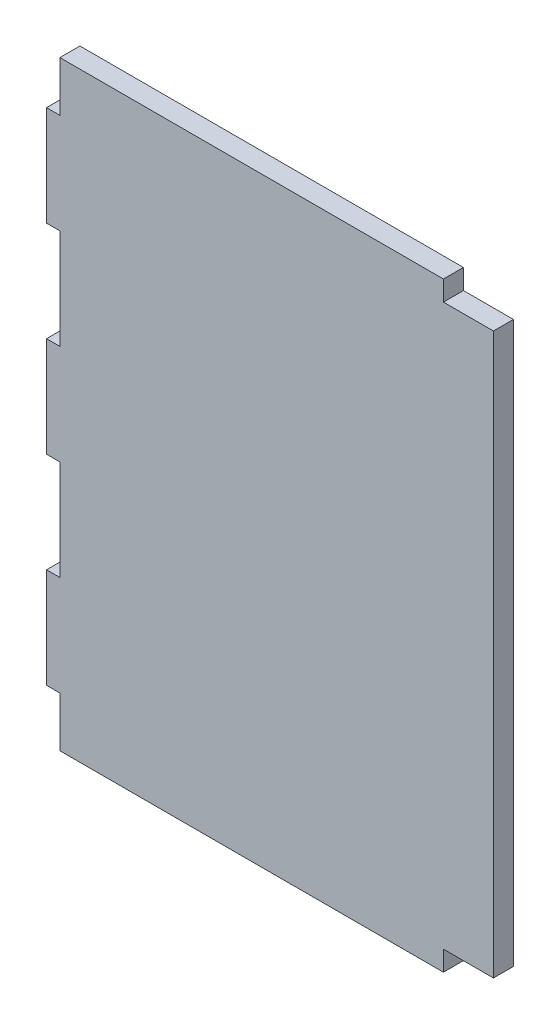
ISO-10303-21;
HEADER;
FILE_DESCRIPTION(('STEP AP214'),'2;1');
FILE_NAME('part.step','',(''),(''),'','','');
FILE_SCHEMA(('AUTOMOTIVE_DESIGN { 1 0 10303 214 1 1 1 1 }'));
ENDSEC;
DATA;
#1=APPLICATION_CONTEXT('core data for automotive mechanical design processes');
#2=APPLICATION_PROTOCOL_DEFINITION('international standard','automotive_design',2000,#1);
#3=PRODUCT_CONTEXT('',#1,'mechanical');
#4=PRODUCT('Part','Part','',(#3));
#5=PRODUCT_RELATED_PRODUCT_CATEGORY('part','',(#4));
#6=PRODUCT_DEFINITION_FORMATION('','',#4);
#7=PRODUCT_DEFINITION_CONTEXT('part definition',#1,'design');
#8=PRODUCT_DEFINITION('design','',#6,#7);
#9=PRODUCT_DEFINITION_SHAPE('','',#8);
#10=(LENGTH_UNIT() NAMED_UNIT(*) SI_UNIT(.MILLI.,.METRE.));
#11=(NAMED_UNIT(*) PLANE_ANGLE_UNIT() SI_UNIT($,.RADIAN.));
#12=(NAMED_UNIT(*) SI_UNIT($,.STERADIAN.) SOLID_ANGLE_UNIT());
#13=UNCERTAINTY_MEASURE_WITH_UNIT(LENGTH_MEASURE(1.E-05),#10,'distance_accuracy_value','');
#14=(GEOMETRIC_REPRESENTATION_CONTEXT(3) GLOBAL_UNCERTAINTY_ASSIGNED_CONTEXT((#13)) GLOBAL_UNIT_ASSIGNED_CONTEXT((#10,
#11,#12)) REPRESENTATION_CONTEXT('',''));
#15=CARTESIAN_POINT('',(0.,0.,0.));
#16=DIRECTION('',(0.,0.,1.));
#17=DIRECTION('',(1.,0.,0.));
#18=AXIS2_PLACEMENT_3D('',#15,#16,#17);
#19=CARTESIAN_POINT('',(0.,6.00000000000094,6.));
#20=DIRECTION('',(0.,-1.,0.));
#21=DIRECTION('',(1.,0.,0.));
#22=AXIS2_PLACEMENT_3D('',#19,#20,#21);
#23=PLANE('',#22);
#24=DIRECTION('',(-1.,0.,0.));
#25=VECTOR('',#24,1.);
#26=CARTESIAN_POINT('',(0.,6.00000000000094,0.));
#27=LINE('',#26,#25);
#28=CARTESIAN_POINT('',(130.,6.00000000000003,0.));
#29=VERTEX_POINT('',#28);
#30=CARTESIAN_POINT('',(115.,6.00000000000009,0.));
#31=VERTEX_POINT('',#30);
#32=EDGE_CURVE('E238',#29,#31,#27,.T.);
#33=ORIENTED_EDGE('',*,*,#32,.F.);
#34=DIRECTION('',(0.,0.,-1.));
#35=VECTOR('',#34,1.);
#36=CARTESIAN_POINT('',(130.,6.00000000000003,6.));
#37=LINE('',#36,#35);
#38=CARTESIAN_POINT('',(130.,6.00000000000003,6.));
#39=VERTEX_POINT('',#38);
#40=EDGE_CURVE('E11',#39,#29,#37,.T.);
#41=ORIENTED_EDGE('',*,*,#40,.F.);
#42=DIRECTION('',(-1.,0.,0.));
#43=VECTOR('',#42,1.);
#44=CARTESIAN_POINT('',(0.,6.00000000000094,6.));
#45=LINE('',#44,#43);
#46=CARTESIAN_POINT('',(115.,6.00000000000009,6.));
#47=VERTEX_POINT('',#46);
#48=EDGE_CURVE('E285',#39,#47,#45,.T.);
#49=ORIENTED_EDGE('',*,*,#48,.T.);
#50=DIRECTION('',(0.,0.,-1.));
#51=VECTOR('',#50,1.);
#52=CARTESIAN_POINT('',(115.,6.00000000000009,6.));
#53=LINE('',#52,#51);
#54=EDGE_CURVE('E124',#47,#31,#53,.T.);
#55=ORIENTED_EDGE('',*,*,#54,.T.);
#56=EDGE_LOOP('',(#33,#41,#49,#55));
#57=FACE_BOUND('',#56,.T.);
#58=ADVANCED_FACE('F38',(#57),#23,.T.);
#59=CARTESIAN_POINT('',(130.,1.20274161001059E-13,6.));
#60=DIRECTION('',(-1.,0.,0.));
#61=DIRECTION('',(0.,-1.,0.));
#62=AXIS2_PLACEMENT_3D('',#59,#60,#61);
#63=PLANE('',#62);
#64=DIRECTION('',(0.,1.,0.));
#65=VECTOR('',#64,1.);
#66=CARTESIAN_POINT('',(130.,1.20274161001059E-13,0.));
#67=LINE('',#66,#65);
#68=CARTESIAN_POINT('',(130.,174.,0.));
#69=VERTEX_POINT('',#68);
#70=EDGE_CURVE('E241',#29,#69,#67,.T.);
#71=ORIENTED_EDGE('',*,*,#70,.T.);
#72=DIRECTION('',(0.,0.,-1.));
#73=VECTOR('',#72,1.);
#74=CARTESIAN_POINT('',(130.,174.,6.));
#75=LINE('',#74,#73);
#76=CARTESIAN_POINT('',(130.,174.,6.));
#77=VERTEX_POINT('',#76);
#78=EDGE_CURVE('E46',#77,#69,#75,.T.);
#79=ORIENTED_EDGE('',*,*,#78,.F.);
#80=DIRECTION('',(0.,1.,0.));
#81=VECTOR('',#80,1.);
#82=CARTESIAN_POINT('',(130.,1.20274161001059E-13,6.));
#83=LINE('',#82,#81);
#84=EDGE_CURVE('E338',#39,#77,#83,.T.);
#85=ORIENTED_EDGE('',*,*,#84,.F.);
#86=ORIENTED_EDGE('',*,*,#40,.T.);
#87=EDGE_LOOP('',(#71,#79,#85,#86));
#88=FACE_BOUND('',#87,.T.);
#89=ADVANCED_FACE('F342',(#88),#63,.F.);
#90=CARTESIAN_POINT('',(0.,174.,6.));
#91=DIRECTION('',(0.,-1.,0.));
#92=DIRECTION('',(0.,0.,-1.));
#93=AXIS2_PLACEMENT_3D('',#90,#91,#92);
#94=PLANE('',#93);
#95=DIRECTION('',(-1.,0.,0.));
#96=VECTOR('',#95,1.);
#97=CARTESIAN_POINT('',(0.,174.,0.));
#98=LINE('',#97,#96);
#99=CARTESIAN_POINT('',(115.,174.,0.));
#100=VERTEX_POINT('',#99);
#101=EDGE_CURVE('E243',#69,#100,#98,.T.);
#102=ORIENTED_EDGE('',*,*,#101,.T.);
#103=DIRECTION('',(0.,0.,-1.));
#104=VECTOR('',#103,1.);
#105=CARTESIAN_POINT('',(115.,174.,6.));
#106=LINE('',#105,#104);
#107=CARTESIAN_POINT('',(115.,174.,6.));
#108=VERTEX_POINT('',#107);
#109=EDGE_CURVE('E317',#108,#100,#106,.T.);
#110=ORIENTED_EDGE('',*,*,#109,.F.);
#111=DIRECTION('',(-1.,0.,0.));
#112=VECTOR('',#111,1.);
#113=CARTESIAN_POINT('',(0.,174.,6.));
#114=LINE('',#113,#112);
#115=EDGE_CURVE('E325',#77,#108,#114,.T.);
#116=ORIENTED_EDGE('',*,*,#115,.F.);
#117=ORIENTED_EDGE('',*,*,#78,.T.);
#118=EDGE_LOOP('',(#102,#110,#116,#117));
#119=FACE_BOUND('',#118,.T.);
#120=ADVANCED_FACE('F323',(#119),#94,.F.);
#121=CARTESIAN_POINT('',(115.,0.,6.));
#122=DIRECTION('',(1.,0.,0.));
#123=DIRECTION('',(0.,0.,-1.));
#124=AXIS2_PLACEMENT_3D('',#121,#122,#123);
#125=PLANE('',#124);
#126=DIRECTION('',(0.,-1.,0.));
#127=VECTOR('',#126,1.);
#128=CARTESIAN_POINT('',(115.,0.,0.));
#129=LINE('',#128,#127);
#130=CARTESIAN_POINT('',(115.,180.,0.));
#131=VERTEX_POINT('',#130);
#132=EDGE_CURVE('E246',#131,#100,#129,.T.);
#133=ORIENTED_EDGE('',*,*,#132,.F.);
#134=DIRECTION('',(0.,0.,-1.));
#135=VECTOR('',#134,1.);
#136=CARTESIAN_POINT('',(115.,180.,6.));
#137=LINE('',#136,#135);
#138=CARTESIAN_POINT('',(115.,180.,6.));
#139=VERTEX_POINT('',#138);
#140=EDGE_CURVE('E315',#139,#131,#137,.T.);
#141=ORIENTED_EDGE('',*,*,#140,.F.);
#142=DIRECTION('',(0.,-1.,0.));
#143=VECTOR('',#142,1.);
#144=CARTESIAN_POINT('',(115.,0.,6.));
#145=LINE('',#144,#143);
#146=EDGE_CURVE('E217',#139,#108,#145,.T.);
#147=ORIENTED_EDGE('',*,*,#146,.T.);
#148=ORIENTED_EDGE('',*,*,#109,.T.);
#149=EDGE_LOOP('',(#133,#141,#147,#148));
#150=FACE_BOUND('',#149,.T.);
#151=ADVANCED_FACE('F333',(#150),#125,.T.);
#152=CARTESIAN_POINT('',(-1.15292391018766E-13,180.,6.));
#153=DIRECTION('',(0.,1.,0.));
#154=DIRECTION('',(-1.,0.,0.));
#155=AXIS2_PLACEMENT_3D('',#152,#153,#154);
#156=PLANE('',#155);
#157=DIRECTION('',(1.,0.,0.));
#158=VECTOR('',#157,1.);
#159=CARTESIAN_POINT('',(-1.15292391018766E-13,180.,0.));
#160=LINE('',#159,#158);
#161=CARTESIAN_POINT('',(0.,180.,0.));
#162=VERTEX_POINT('',#161);
#163=EDGE_CURVE('E249',#162,#131,#160,.T.);
#164=ORIENTED_EDGE('',*,*,#163,.F.);
#165=DIRECTION('',(0.,0.,-1.));
#166=VECTOR('',#165,1.);
#167=CARTESIAN_POINT('',(0.,180.,6.));
#168=LINE('',#167,#166);
#169=CARTESIAN_POINT('',(0.,180.,6.));
#170=VERTEX_POINT('',#169);
#171=EDGE_CURVE('E313',#170,#162,#168,.T.);
#172=ORIENTED_EDGE('',*,*,#171,.F.);
#173=DIRECTION('',(1.,0.,0.));
#174=VECTOR('',#173,1.);
#175=CARTESIAN_POINT('',(-1.15292391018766E-13,180.,6.));
#176=LINE('',#175,#174);
#177=EDGE_CURVE('E212',#170,#139,#176,.T.);
#178=ORIENTED_EDGE('',*,*,#177,.T.);
#179=ORIENTED_EDGE('',*,*,#140,.T.);
#180=EDGE_LOOP('',(#164,#172,#178,#179));
#181=FACE_BOUND('',#180,.T.);
#182=ADVANCED_FACE('F352',(#181),#156,.T.);
#183=CARTESIAN_POINT('',(0.,0.,6.));
#184=DIRECTION('',(-1.,0.,0.));
#185=DIRECTION('',(0.,-1.,0.));
#186=AXIS2_PLACEMENT_3D('',#183,#184,#185);
#187=PLANE('',#186);
#188=DIRECTION('',(0.,1.,0.));
#189=VECTOR('',#188,1.);
#190=CARTESIAN_POINT('',(0.,0.,0.));
#191=LINE('',#190,#189);
#192=CARTESIAN_POINT('',(0.,165.,0.));
#193=VERTEX_POINT('',#192);
#194=EDGE_CURVE('E252',#193,#162,#191,.T.);
#195=ORIENTED_EDGE('',*,*,#194,.F.);
#196=DIRECTION('',(0.,0.,-1.));
#197=VECTOR('',#196,1.);
#198=CARTESIAN_POINT('',(0.,165.,6.));
#199=LINE('',#198,#197);
#200=CARTESIAN_POINT('',(0.,165.,6.));
#201=VERTEX_POINT('',#200);
#202=EDGE_CURVE('E311',#201,#193,#199,.T.);
#203=ORIENTED_EDGE('',*,*,#202,.F.);
#204=DIRECTION('',(0.,1.,0.));
#205=VECTOR('',#204,1.);
#206=CARTESIAN_POINT('',(0.,0.,6.));
#207=LINE('',#206,#205);
#208=EDGE_CURVE('E201',#201,#170,#207,.T.);
#209=ORIENTED_EDGE('',*,*,#208,.T.);
#210=ORIENTED_EDGE('',*,*,#171,.T.);
#211=EDGE_LOOP('',(#195,#203,#209,#210));
#212=FACE_BOUND('',#211,.T.);
#213=ADVANCED_FACE('F355',(#212),#187,.T.);
#214=CARTESIAN_POINT('',(0.,165.,6.));
#215=DIRECTION('',(0.,-1.,0.));
#216=DIRECTION('',(0.,0.,-1.));
#217=AXIS2_PLACEMENT_3D('',#214,#215,#216);
#218=PLANE('',#217);
#219=DIRECTION('',(-1.,0.,0.));
#220=VECTOR('',#219,1.);
#221=CARTESIAN_POINT('',(0.,165.,0.));
#222=LINE('',#221,#220);
#223=CARTESIAN_POINT('',(-4.00000000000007,165.,0.));
#224=VERTEX_POINT('',#223);
#225=EDGE_CURVE('E255',#193,#224,#222,.T.);
#226=ORIENTED_EDGE('',*,*,#225,.T.);
#227=DIRECTION('',(0.,0.,-1.));
#228=VECTOR('',#227,1.);
#229=CARTESIAN_POINT('',(-4.00000000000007,165.,6.));
#230=LINE('',#229,#228);
#231=CARTESIAN_POINT('',(-4.00000000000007,165.,6.));
#232=VERTEX_POINT('',#231);
#233=EDGE_CURVE('E308',#232,#224,#230,.T.);
#234=ORIENTED_EDGE('',*,*,#233,.F.);
#235=DIRECTION('',(-1.,0.,0.));
#236=VECTOR('',#235,1.);
#237=CARTESIAN_POINT('',(0.,165.,6.));
#238=LINE('',#237,#236);
#239=EDGE_CURVE('E211',#201,#232,#238,.T.);
#240=ORIENTED_EDGE('',*,*,#239,.F.);
#241=ORIENTED_EDGE('',*,*,#202,.T.);
#242=EDGE_LOOP('',(#226,#234,#240,#241));
#243=FACE_BOUND('',#242,.T.);
#244=ADVANCED_FACE('F357',(#243),#218,.F.);
#245=CARTESIAN_POINT('',(-3.9999999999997,0.,6.));
#246=DIRECTION('',(1.,0.,0.));
#247=DIRECTION('',(0.,1.,0.));
#248=AXIS2_PLACEMENT_3D('',#245,#246,#247);
#249=PLANE('',#248);
#250=DIRECTION('',(0.,-1.,0.));
#251=VECTOR('',#250,1.);
#252=CARTESIAN_POINT('',(-3.9999999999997,0.,0.));
#253=LINE('',#252,#251);
#254=CARTESIAN_POINT('',(-4.,135.,0.));
#255=VERTEX_POINT('',#254);
#256=EDGE_CURVE('E258',#224,#255,#253,.T.);
#257=ORIENTED_EDGE('',*,*,#256,.T.);
#258=DIRECTION('',(0.,0.,-1.));
#259=VECTOR('',#258,1.);
#260=CARTESIAN_POINT('',(-4.,135.,6.));
#261=LINE('',#260,#259);
#262=CARTESIAN_POINT('',(-4.,135.,6.));
#263=VERTEX_POINT('',#262);
#264=EDGE_CURVE('E306',#263,#255,#261,.T.);
#265=ORIENTED_EDGE('',*,*,#264,.F.);
#266=DIRECTION('',(0.,-1.,0.));
#267=VECTOR('',#266,1.);
#268=CARTESIAN_POINT('',(-3.9999999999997,0.,6.));
#269=LINE('',#268,#267);
#270=EDGE_CURVE('E215',#232,#263,#269,.T.);
#271=ORIENTED_EDGE('',*,*,#270,.F.);
#272=ORIENTED_EDGE('',*,*,#233,.T.);
#273=EDGE_LOOP('',(#257,#265,#271,#272));
#274=FACE_BOUND('',#273,.T.);
#275=ADVANCED_FACE('F360',(#274),#249,.F.);
#276=CARTESIAN_POINT('',(0.,135.,6.));
#277=DIRECTION('',(0.,-1.,0.));
#278=DIRECTION('',(0.,0.,-1.));
#279=AXIS2_PLACEMENT_3D('',#276,#277,#278);
#280=PLANE('',#279);
#281=DIRECTION('',(-1.,0.,0.));
#282=VECTOR('',#281,1.);
#283=CARTESIAN_POINT('',(0.,135.,0.));
#284=LINE('',#283,#282);
#285=CARTESIAN_POINT('',(0.,135.,0.));
#286=VERTEX_POINT('',#285);
#287=EDGE_CURVE('E261',#286,#255,#284,.T.);
#288=ORIENTED_EDGE('',*,*,#287,.F.);
#289=DIRECTION('',(0.,0.,-1.));
#290=VECTOR('',#289,1.);
#291=CARTESIAN_POINT('',(0.,135.,6.));
#292=LINE('',#291,#290);
#293=CARTESIAN_POINT('',(0.,135.,6.));
#294=VERTEX_POINT('',#293);
#295=EDGE_CURVE('E304',#294,#286,#292,.T.);
#296=ORIENTED_EDGE('',*,*,#295,.F.);
#297=DIRECTION('',(-1.,0.,0.));
#298=VECTOR('',#297,1.);
#299=CARTESIAN_POINT('',(0.,135.,6.));
#300=LINE('',#299,#298);
#301=EDGE_CURVE('E220',#294,#263,#300,.T.);
#302=ORIENTED_EDGE('',*,*,#301,.T.);
#303=ORIENTED_EDGE('',*,*,#264,.T.);
#304=EDGE_LOOP('',(#288,#296,#302,#303));
#305=FACE_BOUND('',#304,.T.);
#306=ADVANCED_FACE('F364',(#305),#280,.T.);
#307=CARTESIAN_POINT('',(0.,105.,0.));
#308=VERTEX_POINT('',#307);
#309=EDGE_CURVE('E256',#308,#286,#191,.T.);
#310=ORIENTED_EDGE('',*,*,#309,.F.);
#311=DIRECTION('',(0.,0.,-1.));
#312=VECTOR('',#311,1.);
#313=CARTESIAN_POINT('',(0.,105.,6.));
#314=LINE('',#313,#312);
#315=CARTESIAN_POINT('',(0.,105.,6.));
#316=VERTEX_POINT('',#315);
#317=EDGE_CURVE('E302',#316,#308,#314,.T.);
#318=ORIENTED_EDGE('',*,*,#317,.F.);
#319=EDGE_CURVE('E209',#316,#294,#207,.T.);
#320=ORIENTED_EDGE('',*,*,#319,.T.);
#321=ORIENTED_EDGE('',*,*,#295,.T.);
#322=EDGE_LOOP('',(#310,#318,#320,#321));
#323=FACE_BOUND('',#322,.T.);
#324=ADVANCED_FACE('F368',(#323),#187,.T.);
#325=CARTESIAN_POINT('',(0.,105.,6.));
#326=DIRECTION('',(0.,-1.,0.));
#327=DIRECTION('',(0.,0.,-1.));
#328=AXIS2_PLACEMENT_3D('',#325,#326,#327);
#329=PLANE('',#328);
#330=DIRECTION('',(-1.,0.,0.));
#331=VECTOR('',#330,1.);
#332=CARTESIAN_POINT('',(0.,105.,0.));
#333=LINE('',#332,#331);
#334=CARTESIAN_POINT('',(-4.,105.,0.));
#335=VERTEX_POINT('',#334);
#336=EDGE_CURVE('E264',#308,#335,#333,.T.);
#337=ORIENTED_EDGE('',*,*,#336,.T.);
#338=DIRECTION('',(0.,0.,-1.));
#339=VECTOR('',#338,1.);
#340=CARTESIAN_POINT('',(-4.,105.,6.));
#341=LINE('',#340,#339);
#342=CARTESIAN_POINT('',(-4.,105.,6.));
#343=VERTEX_POINT('',#342);
#344=EDGE_CURVE('E299',#343,#335,#341,.T.);
#345=ORIENTED_EDGE('',*,*,#344,.F.);
#346=DIRECTION('',(-1.,0.,0.));
#347=VECTOR('',#346,1.);
#348=CARTESIAN_POINT('',(0.,105.,6.));
#349=LINE('',#348,#347);
#350=EDGE_CURVE('E219',#316,#343,#349,.T.);
#351=ORIENTED_EDGE('',*,*,#350,.F.);
#352=ORIENTED_EDGE('',*,*,#317,.T.);
#353=EDGE_LOOP('',(#337,#345,#351,#352));
#354=FACE_BOUND('',#353,.T.);
#355=ADVANCED_FACE('F369',(#354),#329,.F.);
#356=CARTESIAN_POINT('',(-3.99999999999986,0.,6.));
#357=DIRECTION('',(1.,0.,0.));
#358=DIRECTION('',(0.,1.,0.));
#359=AXIS2_PLACEMENT_3D('',#356,#357,#358);
#360=PLANE('',#359);
#361=DIRECTION('',(0.,-1.,0.));
#362=VECTOR('',#361,1.);
#363=CARTESIAN_POINT('',(-3.99999999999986,0.,0.));
#364=LINE('',#363,#362);
#365=CARTESIAN_POINT('',(-3.99999999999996,75.,0.));
#366=VERTEX_POINT('',#365);
#367=EDGE_CURVE('E266',#335,#366,#364,.T.);
#368=ORIENTED_EDGE('',*,*,#367,.T.);
#369=DIRECTION('',(0.,0.,-1.));
#370=VECTOR('',#369,1.);
#371=CARTESIAN_POINT('',(-3.99999999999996,75.,6.));
#372=LINE('',#371,#370);
#373=CARTESIAN_POINT('',(-3.99999999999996,75.,6.));
#374=VERTEX_POINT('',#373);
#375=EDGE_CURVE('E297',#374,#366,#372,.T.);
#376=ORIENTED_EDGE('',*,*,#375,.F.);
#377=DIRECTION('',(0.,-1.,0.));
#378=VECTOR('',#377,1.);
#379=CARTESIAN_POINT('',(-3.99999999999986,0.,6.));
#380=LINE('',#379,#378);
#381=EDGE_CURVE('E223',#343,#374,#380,.T.);
#382=ORIENTED_EDGE('',*,*,#381,.F.);
#383=ORIENTED_EDGE('',*,*,#344,.T.);
#384=EDGE_LOOP('',(#368,#376,#382,#383));
#385=FACE_BOUND('',#384,.T.);
#386=ADVANCED_FACE('F372',(#385),#360,.F.);
#387=CARTESIAN_POINT('',(0.,75.,6.));
#388=DIRECTION('',(0.,-1.,0.));
#389=DIRECTION('',(0.,0.,-1.));
#390=AXIS2_PLACEMENT_3D('',#387,#388,#389);
#391=PLANE('',#390);
#392=DIRECTION('',(-1.,0.,0.));
#393=VECTOR('',#392,1.);
#394=CARTESIAN_POINT('',(0.,75.,0.));
#395=LINE('',#394,#393);
#396=CARTESIAN_POINT('',(0.,75.,0.));
#397=VERTEX_POINT('',#396);
#398=EDGE_CURVE('E269',#397,#366,#395,.T.);
#399=ORIENTED_EDGE('',*,*,#398,.F.);
#400=DIRECTION('',(0.,0.,-1.));
#401=VECTOR('',#400,1.);
#402=CARTESIAN_POINT('',(0.,75.,6.));
#403=LINE('',#402,#401);
#404=CARTESIAN_POINT('',(0.,75.,6.));
#405=VERTEX_POINT('',#404);
#406=EDGE_CURVE('E295',#405,#397,#403,.T.);
#407=ORIENTED_EDGE('',*,*,#406,.F.);
#408=DIRECTION('',(-1.,0.,0.));
#409=VECTOR('',#408,1.);
#410=CARTESIAN_POINT('',(0.,75.,6.));
#411=LINE('',#410,#409);
#412=EDGE_CURVE('E208',#405,#374,#411,.T.);
#413=ORIENTED_EDGE('',*,*,#412,.T.);
#414=ORIENTED_EDGE('',*,*,#375,.T.);
#415=EDGE_LOOP('',(#399,#407,#413,#414));
#416=FACE_BOUND('',#415,.T.);
#417=ADVANCED_FACE('F376',(#416),#391,.T.);
#418=CARTESIAN_POINT('',(0.,45.,0.));
#419=VERTEX_POINT('',#418);
#420=EDGE_CURVE('E272',#419,#397,#191,.T.);
#421=ORIENTED_EDGE('',*,*,#420,.F.);
#422=DIRECTION('',(0.,0.,-1.));
#423=VECTOR('',#422,1.);
#424=CARTESIAN_POINT('',(0.,45.,6.));
#425=LINE('',#424,#423);
#426=CARTESIAN_POINT('',(0.,45.,6.));
#427=VERTEX_POINT('',#426);
#428=EDGE_CURVE('E293',#427,#419,#425,.T.);
#429=ORIENTED_EDGE('',*,*,#428,.F.);
#430=EDGE_CURVE('E200',#427,#405,#207,.T.);
#431=ORIENTED_EDGE('',*,*,#430,.T.);
#432=ORIENTED_EDGE('',*,*,#406,.T.);
#433=EDGE_LOOP('',(#421,#429,#431,#432));
#434=FACE_BOUND('',#433,.T.);
#435=ADVANCED_FACE('F380',(#434),#187,.T.);
#436=CARTESIAN_POINT('',(0.,45.,6.));
#437=DIRECTION('',(0.,-1.,0.));
#438=DIRECTION('',(0.,0.,-1.));
#439=AXIS2_PLACEMENT_3D('',#436,#437,#438);
#440=PLANE('',#439);
#441=DIRECTION('',(-1.,0.,0.));
#442=VECTOR('',#441,1.);
#443=CARTESIAN_POINT('',(0.,45.,0.));
#444=LINE('',#443,#442);
#445=CARTESIAN_POINT('',(-4.00000000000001,45.,0.));
#446=VERTEX_POINT('',#445);
#447=EDGE_CURVE('E273',#419,#446,#444,.T.);
#448=ORIENTED_EDGE('',*,*,#447,.T.);
#449=DIRECTION('',(0.,0.,-1.));
#450=VECTOR('',#449,1.);
#451=CARTESIAN_POINT('',(-4.00000000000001,45.,6.));
#452=LINE('',#451,#450);
#453=CARTESIAN_POINT('',(-4.00000000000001,45.,6.));
#454=VERTEX_POINT('',#453);
#455=EDGE_CURVE('E291',#454,#446,#452,.T.);
#456=ORIENTED_EDGE('',*,*,#455,.F.);
#457=DIRECTION('',(-1.,0.,0.));
#458=VECTOR('',#457,1.);
#459=CARTESIAN_POINT('',(0.,45.,6.));
#460=LINE('',#459,#458);
#461=EDGE_CURVE('E207',#427,#454,#460,.T.);
#462=ORIENTED_EDGE('',*,*,#461,.F.);
#463=ORIENTED_EDGE('',*,*,#428,.T.);
#464=EDGE_LOOP('',(#448,#456,#462,#463));
#465=FACE_BOUND('',#464,.T.);
#466=ADVANCED_FACE('F382',(#465),#440,.F.);
#467=CARTESIAN_POINT('',(-4.00000000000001,0.,6.));
#468=DIRECTION('',(-1.,0.,0.));
#469=DIRECTION('',(0.,0.,1.));
#470=AXIS2_PLACEMENT_3D('',#467,#468,#469);
#471=PLANE('',#470);
#472=DIRECTION('',(0.,1.,0.));
#473=VECTOR('',#472,1.);
#474=CARTESIAN_POINT('',(-4.00000000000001,0.,0.));
#475=LINE('',#474,#473);
#476=CARTESIAN_POINT('',(-4.00000000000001,15.,0.));
#477=VERTEX_POINT('',#476);
#478=EDGE_CURVE('E276',#477,#446,#475,.T.);
#479=ORIENTED_EDGE('',*,*,#478,.F.);
#480=DIRECTION('',(0.,0.,-1.));
#481=VECTOR('',#480,1.);
#482=CARTESIAN_POINT('',(-4.00000000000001,15.,6.));
#483=LINE('',#482,#481);
#484=CARTESIAN_POINT('',(-4.00000000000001,15.,6.));
#485=VERTEX_POINT('',#484);
#486=EDGE_CURVE('E289',#485,#477,#483,.T.);
#487=ORIENTED_EDGE('',*,*,#486,.F.);
#488=DIRECTION('',(0.,1.,0.));
#489=VECTOR('',#488,1.);
#490=CARTESIAN_POINT('',(-4.00000000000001,0.,6.));
#491=LINE('',#490,#489);
#492=EDGE_CURVE('E202',#485,#454,#491,.T.);
#493=ORIENTED_EDGE('',*,*,#492,.T.);
#494=ORIENTED_EDGE('',*,*,#455,.T.);
#495=EDGE_LOOP('',(#479,#487,#493,#494));
#496=FACE_BOUND('',#495,.T.);
#497=ADVANCED_FACE('F385',(#496),#471,.T.);
#498=CARTESIAN_POINT('',(0.,15.,6.));
#499=DIRECTION('',(0.,-1.,0.));
#500=DIRECTION('',(0.,0.,-1.));
#501=AXIS2_PLACEMENT_3D('',#498,#499,#500);
#502=PLANE('',#501);
#503=DIRECTION('',(-1.,0.,0.));
#504=VECTOR('',#503,1.);
#505=CARTESIAN_POINT('',(0.,15.,0.));
#506=LINE('',#505,#504);
#507=CARTESIAN_POINT('',(0.,15.,0.));
#508=VERTEX_POINT('',#507);
#509=EDGE_CURVE('E279',#508,#477,#506,.T.);
#510=ORIENTED_EDGE('',*,*,#509,.F.);
#511=DIRECTION('',(0.,0.,-1.));
#512=VECTOR('',#511,1.);
#513=CARTESIAN_POINT('',(0.,15.,6.));
#514=LINE('',#513,#512);
#515=CARTESIAN_POINT('',(0.,15.,6.));
#516=VERTEX_POINT('',#515);
#517=EDGE_CURVE('E188',#516,#508,#514,.T.);
#518=ORIENTED_EDGE('',*,*,#517,.F.);
#519=DIRECTION('',(-1.,0.,0.));
#520=VECTOR('',#519,1.);
#521=CARTESIAN_POINT('',(0.,15.,6.));
#522=LINE('',#521,#520);
#523=EDGE_CURVE('E198',#516,#485,#522,.T.);
#524=ORIENTED_EDGE('',*,*,#523,.T.);
#525=ORIENTED_EDGE('',*,*,#486,.T.);
#526=EDGE_LOOP('',(#510,#518,#524,#525));
#527=FACE_BOUND('',#526,.T.);
#528=ADVANCED_FACE('F389',(#527),#502,.T.);
#529=CARTESIAN_POINT('',(0.,0.,0.));
#530=VERTEX_POINT('',#529);
#531=EDGE_CURVE('E187',#530,#508,#191,.T.);
#532=ORIENTED_EDGE('',*,*,#531,.F.);
#533=DIRECTION('',(0.,0.,-1.));
#534=VECTOR('',#533,1.);
#535=CARTESIAN_POINT('',(0.,0.,6.));
#536=LINE('',#535,#534);
#537=CARTESIAN_POINT('',(0.,0.,6.));
#538=VERTEX_POINT('',#537);
#539=EDGE_CURVE('E181',#538,#530,#536,.T.);
#540=ORIENTED_EDGE('',*,*,#539,.F.);
#541=EDGE_CURVE('E185',#538,#516,#207,.T.);
#542=ORIENTED_EDGE('',*,*,#541,.T.);
#543=ORIENTED_EDGE('',*,*,#517,.T.);
#544=EDGE_LOOP('',(#532,#540,#542,#543));
#545=FACE_BOUND('',#544,.T.);
#546=ADVANCED_FACE('F183',(#545),#187,.T.);
#547=CARTESIAN_POINT('',(0.,0.,6.));
#548=DIRECTION('',(0.,1.,0.));
#549=DIRECTION('',(0.,0.,1.));
#550=AXIS2_PLACEMENT_3D('',#547,#548,#549);
#551=PLANE('',#550);
#552=DIRECTION('',(1.,0.,0.));
#553=VECTOR('',#552,1.);
#554=CARTESIAN_POINT('',(0.,0.,0.));
#555=LINE('',#554,#553);
#556=CARTESIAN_POINT('',(115.,0.,0.));
#557=VERTEX_POINT('',#556);
#558=EDGE_CURVE('E117',#530,#557,#555,.T.);
#559=ORIENTED_EDGE('',*,*,#558,.T.);
#560=DIRECTION('',(0.,0.,-1.));
#561=VECTOR('',#560,1.);
#562=CARTESIAN_POINT('',(115.,0.,6.));
#563=LINE('',#562,#561);
#564=CARTESIAN_POINT('',(115.,0.,6.));
#565=VERTEX_POINT('',#564);
#566=EDGE_CURVE('E189',#565,#557,#563,.T.);
#567=ORIENTED_EDGE('',*,*,#566,.F.);
#568=DIRECTION('',(1.,0.,0.));
#569=VECTOR('',#568,1.);
#570=CARTESIAN_POINT('',(0.,0.,6.));
#571=LINE('',#570,#569);
#572=EDGE_CURVE('E191',#538,#565,#571,.T.);
#573=ORIENTED_EDGE('',*,*,#572,.F.);
#574=ORIENTED_EDGE('',*,*,#539,.T.);
#575=EDGE_LOOP('',(#559,#567,#573,#574));
#576=FACE_BOUND('',#575,.T.);
#577=ADVANCED_FACE('F192',(#576),#551,.F.);
#578=CARTESIAN_POINT('',(115.,0.,6.));
#579=DIRECTION('',(-1.,0.,0.));
#580=DIRECTION('',(0.,0.,1.));
#581=AXIS2_PLACEMENT_3D('',#578,#579,#580);
#582=PLANE('',#581);
#583=DIRECTION('',(0.,1.,0.));
#584=VECTOR('',#583,1.);
#585=CARTESIAN_POINT('',(115.,0.,0.));
#586=LINE('',#585,#584);
#587=EDGE_CURVE('E283',#557,#31,#586,.T.);
#588=ORIENTED_EDGE('',*,*,#587,.T.);
#589=ORIENTED_EDGE('',*,*,#54,.F.);
#590=DIRECTION('',(0.,1.,0.));
#591=VECTOR('',#590,1.);
#592=CARTESIAN_POINT('',(115.,0.,6.));
#593=LINE('',#592,#591);
#594=EDGE_CURVE('E54',#565,#47,#593,.T.);
#595=ORIENTED_EDGE('',*,*,#594,.F.);
#596=ORIENTED_EDGE('',*,*,#566,.T.);
#597=EDGE_LOOP('',(#588,#589,#595,#596));
#598=FACE_BOUND('',#597,.T.);
#599=ADVANCED_FACE('F398',(#598),#582,.F.);
#600=CARTESIAN_POINT('',(0.,0.,6.));
#601=DIRECTION('',(0.,0.,1.));
#602=DIRECTION('',(1.,0.,0.));
#603=AXIS2_PLACEMENT_3D('',#600,#601,#602);
#604=PLANE('',#603);
#605=ORIENTED_EDGE('',*,*,#48,.F.);
#606=ORIENTED_EDGE('',*,*,#84,.T.);
#607=ORIENTED_EDGE('',*,*,#115,.T.);
#608=ORIENTED_EDGE('',*,*,#146,.F.);
#609=ORIENTED_EDGE('',*,*,#177,.F.);
#610=ORIENTED_EDGE('',*,*,#208,.F.);
#611=ORIENTED_EDGE('',*,*,#239,.T.);
#612=ORIENTED_EDGE('',*,*,#270,.T.);
#613=ORIENTED_EDGE('',*,*,#301,.F.);
#614=ORIENTED_EDGE('',*,*,#319,.F.);
#615=ORIENTED_EDGE('',*,*,#350,.T.);
#616=ORIENTED_EDGE('',*,*,#381,.T.);
#617=ORIENTED_EDGE('',*,*,#412,.F.);
#618=ORIENTED_EDGE('',*,*,#430,.F.);
#619=ORIENTED_EDGE('',*,*,#461,.T.);
#620=ORIENTED_EDGE('',*,*,#492,.F.);
#621=ORIENTED_EDGE('',*,*,#523,.F.);
#622=ORIENTED_EDGE('',*,*,#541,.F.);
#623=ORIENTED_EDGE('',*,*,#572,.T.);
#624=ORIENTED_EDGE('',*,*,#594,.T.);
#625=EDGE_LOOP('',(#605,#606,#607,#608,#609,#610,#611,#612,#613,#614,#615,#616,#617,#618,#619,
#620,#621,#622,#623,#624));
#626=FACE_BOUND('',#625,.T.);
#627=ADVANCED_FACE('F195',(#626),#604,.T.);
#628=CARTESIAN_POINT('',(0.,0.,0.));
#629=DIRECTION('',(0.,0.,1.));
#630=DIRECTION('',(1.,0.,0.));
#631=AXIS2_PLACEMENT_3D('',#628,#629,#630);
#632=PLANE('',#631);
#633=ORIENTED_EDGE('',*,*,#32,.T.);
#634=ORIENTED_EDGE('',*,*,#587,.F.);
#635=ORIENTED_EDGE('',*,*,#558,.F.);
#636=ORIENTED_EDGE('',*,*,#531,.T.);
#637=ORIENTED_EDGE('',*,*,#509,.T.);
#638=ORIENTED_EDGE('',*,*,#478,.T.);
#639=ORIENTED_EDGE('',*,*,#447,.F.);
#640=ORIENTED_EDGE('',*,*,#420,.T.);
#641=ORIENTED_EDGE('',*,*,#398,.T.);
#642=ORIENTED_EDGE('',*,*,#367,.F.);
#643=ORIENTED_EDGE('',*,*,#336,.F.);
#644=ORIENTED_EDGE('',*,*,#309,.T.);
#645=ORIENTED_EDGE('',*,*,#287,.T.);
#646=ORIENTED_EDGE('',*,*,#256,.F.);
#647=ORIENTED_EDGE('',*,*,#225,.F.);
#648=ORIENTED_EDGE('',*,*,#194,.T.);
#649=ORIENTED_EDGE('',*,*,#163,.T.);
#650=ORIENTED_EDGE('',*,*,#132,.T.);
#651=ORIENTED_EDGE('',*,*,#101,.F.);
#652=ORIENTED_EDGE('',*,*,#70,.F.);
#653=EDGE_LOOP('',(#633,#634,#635,#636,#637,#638,#639,#640,#641,#642,#643,#644,#645,#646,#647,
#648,#649,#650,#651,#652));
#654=FACE_BOUND('',#653,.T.);
#655=ADVANCED_FACE('F329',(#654),#632,.F.);
#656=CLOSED_SHELL('',(#58,#89,#120,#151,#182,#213,#244,#275,#306,#324,#355,#386,#417,#435,#466,
#497,#528,#546,#577,#599,#627,#655));
#657=MANIFOLD_SOLID_BREP('B2',#656);
#658=ADVANCED_BREP_SHAPE_REPRESENTATION('',(#18,#657),#14);
#659=SHAPE_DEFINITION_REPRESENTATION(#9,#658);
ENDSEC;
END-ISO-10303-21;
